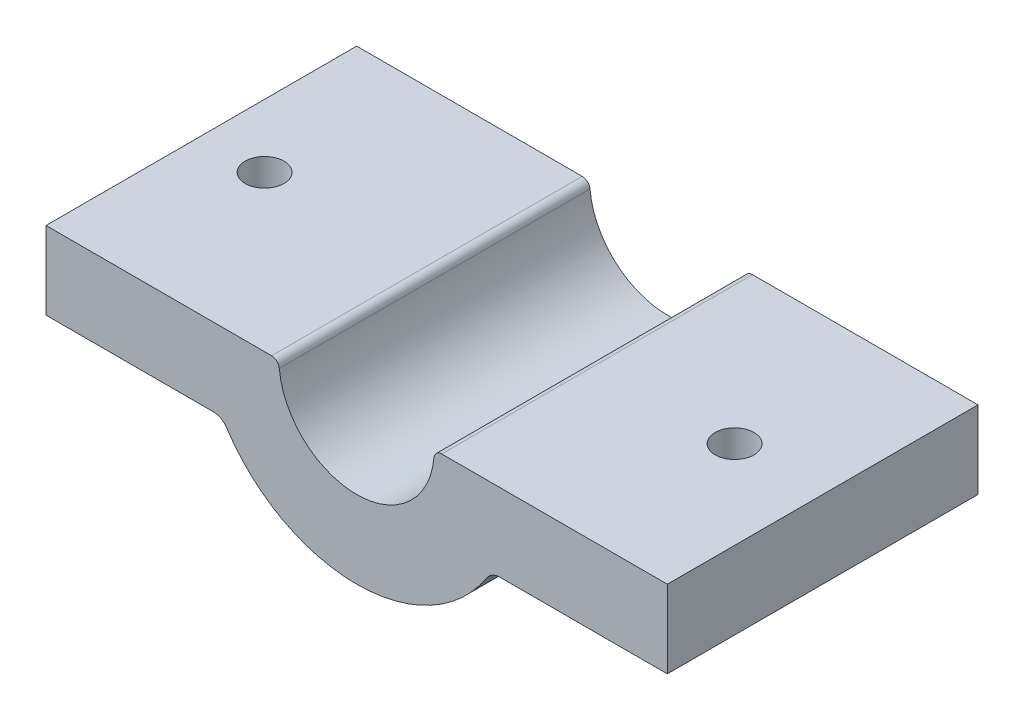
from build123d import *

# Parameters (mm, degrees)
BOSS_EXTRUDE1_DEPTH = 20
SKETCH2_R           = 1.25
CUT_EXTRUDE1_DEPTH  = 20
FILLET1_R           = 1


with BuildPart() as part:
    # Sketch1 → Boss-Extrude1 (new body)
    with BuildSketch(Plane.XY):
        with BuildLine():
            Line((5.477225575, 0), (20, 0))
            Line((20, 0), (20, -5))
            Line((20, -5), (8.660254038, -5))
            ThreePointArc((8.660254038, -5), (0, -10), (-8.660254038, -5))
            Line((-8.660254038, -5), (-20, -5))
            Line((-20, -5), (-20, 0))
            Line((-20, 0), (-5.477225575, 0))
            ThreePointArc((-5.477225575, 0), (-5.140125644, -0.130725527), (-4.979295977, -0.454545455))
            ThreePointArc((-4.979295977, -0.454545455), (0, -5), (4.979295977, -0.454545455))
            ThreePointArc((4.979295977, -0.454545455), (5.140125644, -0.130725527), (5.477225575, 0))
        make_face()
    extrude(amount=-BOSS_EXTRUDE1_DEPTH)

    # Sketch2 → Cut-Extrude1 (cut)
    with BuildSketch(Plane.XZ.offset(5)):
        with Locations(Location((-15.928078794, -10, 0), (0, 0, 270))):
            Circle(SKETCH2_R)
        with Locations(Location((14.330127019, -10, 0), (0, 0, 270))):
            Circle(SKETCH2_R)
    extrude(amount=-CUT_EXTRUDE1_DEPTH, mode=Mode.SUBTRACT)

    # Fillet1
    fillet1_edges = [part.edges().sort_by_distance(p)[0] for p in [
        (8.660254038, -5, -10),
        (-8.660254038, -5, -10),
    ]]
    fillet(fillet1_edges, radius=FILLET1_R)


solid = part.part
